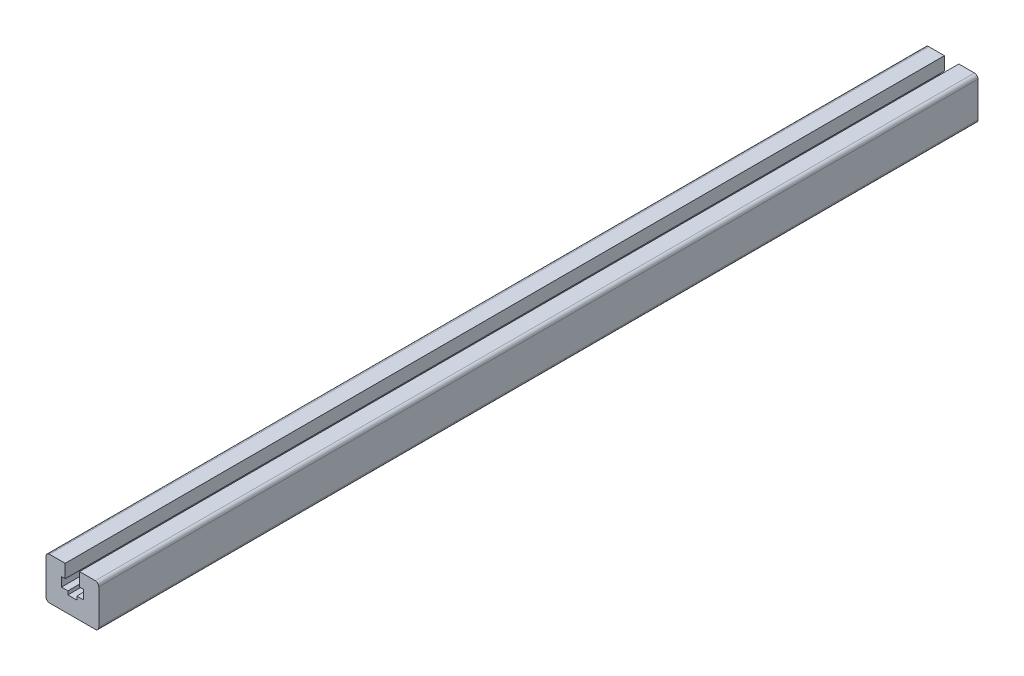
ISO-10303-21;
HEADER;
FILE_DESCRIPTION(('STEP AP214'),'2;1');
FILE_NAME('part.step','',(''),(''),'','','');
FILE_SCHEMA(('AUTOMOTIVE_DESIGN { 1 0 10303 214 1 1 1 1 }'));
ENDSEC;
DATA;
#1=APPLICATION_CONTEXT('core data for automotive mechanical design processes');
#2=APPLICATION_PROTOCOL_DEFINITION('international standard','automotive_design',2000,#1);
#3=PRODUCT_CONTEXT('',#1,'mechanical');
#4=PRODUCT('Part','Part','',(#3));
#5=PRODUCT_RELATED_PRODUCT_CATEGORY('part','',(#4));
#6=PRODUCT_DEFINITION_FORMATION('','',#4);
#7=PRODUCT_DEFINITION_CONTEXT('part definition',#1,'design');
#8=PRODUCT_DEFINITION('design','',#6,#7);
#9=PRODUCT_DEFINITION_SHAPE('','',#8);
#10=(LENGTH_UNIT() NAMED_UNIT(*) SI_UNIT(.MILLI.,.METRE.));
#11=(NAMED_UNIT(*) PLANE_ANGLE_UNIT() SI_UNIT($,.RADIAN.));
#12=(NAMED_UNIT(*) SI_UNIT($,.STERADIAN.) SOLID_ANGLE_UNIT());
#13=UNCERTAINTY_MEASURE_WITH_UNIT(LENGTH_MEASURE(1.E-05),#10,'distance_accuracy_value','');
#14=(GEOMETRIC_REPRESENTATION_CONTEXT(3) GLOBAL_UNCERTAINTY_ASSIGNED_CONTEXT((#13)) GLOBAL_UNIT_ASSIGNED_CONTEXT((#10,
#11,#12)) REPRESENTATION_CONTEXT('',''));
#15=CARTESIAN_POINT('',(0.,0.,0.));
#16=DIRECTION('',(0.,0.,1.));
#17=DIRECTION('',(1.,0.,0.));
#18=AXIS2_PLACEMENT_3D('',#15,#16,#17);
#19=CARTESIAN_POINT('',(4.09999618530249,24.,500.));
#20=DIRECTION('',(0.,1.,0.));
#21=DIRECTION('',(0.,0.,-1.));
#22=AXIS2_PLACEMENT_3D('',#19,#20,#21);
#23=PLANE('',#22);
#24=DIRECTION('',(0.,0.,-1.));
#25=VECTOR('',#24,1.);
#26=CARTESIAN_POINT('',(-4.1,24.,500.));
#27=LINE('',#26,#25);
#28=CARTESIAN_POINT('',(-4.1,24.,500.));
#29=VERTEX_POINT('',#28);
#30=CARTESIAN_POINT('',(-4.1,24.,0.));
#31=VERTEX_POINT('',#30);
#32=EDGE_CURVE('E221',#29,#31,#27,.T.);
#33=ORIENTED_EDGE('',*,*,#32,.T.);
#34=DIRECTION('',(1.,0.,0.));
#35=VECTOR('',#34,1.);
#36=CARTESIAN_POINT('',(4.09999618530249,24.,0.));
#37=LINE('',#36,#35);
#38=CARTESIAN_POINT('',(-13.,24.,0.));
#39=VERTEX_POINT('',#38);
#40=EDGE_CURVE('E172',#39,#31,#37,.T.);
#41=ORIENTED_EDGE('',*,*,#40,.F.);
#42=DIRECTION('',(0.,0.,-1.));
#43=VECTOR('',#42,1.);
#44=CARTESIAN_POINT('',(-13.,24.,500.));
#45=LINE('',#44,#43);
#46=CARTESIAN_POINT('',(-13.,24.,500.));
#47=VERTEX_POINT('',#46);
#48=EDGE_CURVE('E9',#47,#39,#45,.T.);
#49=ORIENTED_EDGE('',*,*,#48,.F.);
#50=DIRECTION('',(1.,0.,0.));
#51=VECTOR('',#50,1.);
#52=CARTESIAN_POINT('',(-13.,24.,500.));
#53=LINE('',#52,#51);
#54=EDGE_CURVE('E171',#47,#29,#53,.T.);
#55=ORIENTED_EDGE('',*,*,#54,.T.);
#56=EDGE_LOOP('',(#33,#41,#49,#55));
#57=FACE_BOUND('',#56,.T.);
#58=ADVANCED_FACE('F14',(#57),#23,.T.);
#59=CARTESIAN_POINT('',(-13.,22.,500.));
#60=DIRECTION('',(0.,0.,-1.));
#61=DIRECTION('',(-1.,0.,0.));
#62=AXIS2_PLACEMENT_3D('',#59,#60,#61);
#63=CYLINDRICAL_SURFACE('',#62,2.);
#64=DIRECTION('',(0.,0.,-1.));
#65=VECTOR('',#64,1.);
#66=CARTESIAN_POINT('',(-15.,22.,500.));
#67=LINE('',#66,#65);
#68=CARTESIAN_POINT('',(-15.,22.,500.));
#69=VERTEX_POINT('',#68);
#70=CARTESIAN_POINT('',(-15.,22.,0.));
#71=VERTEX_POINT('',#70);
#72=EDGE_CURVE('E22',#69,#71,#67,.T.);
#73=ORIENTED_EDGE('',*,*,#72,.F.);
#74=CARTESIAN_POINT('',(-13.,22.,500.));
#75=DIRECTION('',(0.,0.,-1.));
#76=DIRECTION('',(-1.,0.,0.));
#77=AXIS2_PLACEMENT_3D('',#74,#75,#76);
#78=CIRCLE('',#77,2.);
#79=EDGE_CURVE('E175',#69,#47,#78,.T.);
#80=ORIENTED_EDGE('',*,*,#79,.T.);
#81=ORIENTED_EDGE('',*,*,#48,.T.);
#82=CARTESIAN_POINT('',(-13.,22.,0.));
#83=DIRECTION('',(0.,0.,-1.));
#84=DIRECTION('',(-1.,0.,0.));
#85=AXIS2_PLACEMENT_3D('',#82,#83,#84);
#86=CIRCLE('',#85,2.);
#87=EDGE_CURVE('E219',#71,#39,#86,.T.);
#88=ORIENTED_EDGE('',*,*,#87,.F.);
#89=EDGE_LOOP('',(#73,#80,#81,#88));
#90=FACE_BOUND('',#89,.T.);
#91=ADVANCED_FACE('F16',(#90),#63,.T.);
#92=CARTESIAN_POINT('',(-15.,2.,500.));
#93=DIRECTION('',(-1.,0.,0.));
#94=DIRECTION('',(0.,0.,1.));
#95=AXIS2_PLACEMENT_3D('',#92,#93,#94);
#96=PLANE('',#95);
#97=DIRECTION('',(0.,0.,-1.));
#98=VECTOR('',#97,1.);
#99=CARTESIAN_POINT('',(-15.,2.,500.));
#100=LINE('',#99,#98);
#101=CARTESIAN_POINT('',(-15.,2.,500.));
#102=VERTEX_POINT('',#101);
#103=CARTESIAN_POINT('',(-15.,2.,0.));
#104=VERTEX_POINT('',#103);
#105=EDGE_CURVE('E207',#102,#104,#100,.T.);
#106=ORIENTED_EDGE('',*,*,#105,.F.);
#107=DIRECTION('',(0.,1.,0.));
#108=VECTOR('',#107,1.);
#109=CARTESIAN_POINT('',(-15.,2.,500.));
#110=LINE('',#109,#108);
#111=EDGE_CURVE('E182',#102,#69,#110,.T.);
#112=ORIENTED_EDGE('',*,*,#111,.T.);
#113=ORIENTED_EDGE('',*,*,#72,.T.);
#114=DIRECTION('',(0.,1.,0.));
#115=VECTOR('',#114,1.);
#116=CARTESIAN_POINT('',(-15.,2.,0.));
#117=LINE('',#116,#115);
#118=EDGE_CURVE('E213',#104,#71,#117,.T.);
#119=ORIENTED_EDGE('',*,*,#118,.F.);
#120=EDGE_LOOP('',(#106,#112,#113,#119));
#121=FACE_BOUND('',#120,.T.);
#122=ADVANCED_FACE('F211',(#121),#96,.T.);
#123=CARTESIAN_POINT('',(-13.,2.,500.));
#124=DIRECTION('',(0.,0.,-1.));
#125=DIRECTION('',(-1.,0.,0.));
#126=AXIS2_PLACEMENT_3D('',#123,#124,#125);
#127=CYLINDRICAL_SURFACE('',#126,2.);
#128=DIRECTION('',(0.,0.,-1.));
#129=VECTOR('',#128,1.);
#130=CARTESIAN_POINT('',(-13.,0.,500.));
#131=LINE('',#130,#129);
#132=CARTESIAN_POINT('',(-13.,0.,500.));
#133=VERTEX_POINT('',#132);
#134=CARTESIAN_POINT('',(-13.,0.,0.));
#135=VERTEX_POINT('',#134);
#136=EDGE_CURVE('E205',#133,#135,#131,.T.);
#137=ORIENTED_EDGE('',*,*,#136,.F.);
#138=CARTESIAN_POINT('',(-13.,2.,500.));
#139=DIRECTION('',(0.,0.,-1.));
#140=DIRECTION('',(-1.,0.,0.));
#141=AXIS2_PLACEMENT_3D('',#138,#139,#140);
#142=CIRCLE('',#141,2.);
#143=EDGE_CURVE('E185',#133,#102,#142,.T.);
#144=ORIENTED_EDGE('',*,*,#143,.T.);
#145=ORIENTED_EDGE('',*,*,#105,.T.);
#146=CARTESIAN_POINT('',(-13.,2.,0.));
#147=DIRECTION('',(0.,0.,-1.));
#148=DIRECTION('',(-1.,0.,0.));
#149=AXIS2_PLACEMENT_3D('',#146,#147,#148);
#150=CIRCLE('',#149,2.);
#151=EDGE_CURVE('E227',#135,#104,#150,.T.);
#152=ORIENTED_EDGE('',*,*,#151,.F.);
#153=EDGE_LOOP('',(#137,#144,#145,#152));
#154=FACE_BOUND('',#153,.T.);
#155=ADVANCED_FACE('F259',(#154),#127,.T.);
#156=CARTESIAN_POINT('',(-13.,0.,500.));
#157=DIRECTION('',(0.,1.,0.));
#158=DIRECTION('',(0.,0.,-1.));
#159=AXIS2_PLACEMENT_3D('',#156,#157,#158);
#160=PLANE('',#159);
#161=DIRECTION('',(0.,0.,-1.));
#162=VECTOR('',#161,1.);
#163=CARTESIAN_POINT('',(13.,0.,500.));
#164=LINE('',#163,#162);
#165=CARTESIAN_POINT('',(13.,0.,500.));
#166=VERTEX_POINT('',#165);
#167=CARTESIAN_POINT('',(13.,0.,0.));
#168=VERTEX_POINT('',#167);
#169=EDGE_CURVE('E203',#166,#168,#164,.T.);
#170=ORIENTED_EDGE('',*,*,#169,.F.);
#171=DIRECTION('',(1.,0.,0.));
#172=VECTOR('',#171,1.);
#173=CARTESIAN_POINT('',(-13.,0.,500.));
#174=LINE('',#173,#172);
#175=EDGE_CURVE('E188',#133,#166,#174,.T.);
#176=ORIENTED_EDGE('',*,*,#175,.F.);
#177=ORIENTED_EDGE('',*,*,#136,.T.);
#178=DIRECTION('',(1.,0.,0.));
#179=VECTOR('',#178,1.);
#180=CARTESIAN_POINT('',(-13.,0.,0.));
#181=LINE('',#180,#179);
#182=EDGE_CURVE('E229',#135,#168,#181,.T.);
#183=ORIENTED_EDGE('',*,*,#182,.T.);
#184=EDGE_LOOP('',(#170,#176,#177,#183));
#185=FACE_BOUND('',#184,.T.);
#186=ADVANCED_FACE('F256',(#185),#160,.F.);
#187=CARTESIAN_POINT('',(13.,2.,500.));
#188=DIRECTION('',(0.,0.,-1.));
#189=DIRECTION('',(-1.,0.,0.));
#190=AXIS2_PLACEMENT_3D('',#187,#188,#189);
#191=CYLINDRICAL_SURFACE('',#190,2.);
#192=DIRECTION('',(0.,0.,-1.));
#193=VECTOR('',#192,1.);
#194=CARTESIAN_POINT('',(15.,2.,500.));
#195=LINE('',#194,#193);
#196=CARTESIAN_POINT('',(15.,2.,500.));
#197=VERTEX_POINT('',#196);
#198=CARTESIAN_POINT('',(15.,2.,0.));
#199=VERTEX_POINT('',#198);
#200=EDGE_CURVE('E201',#197,#199,#195,.T.);
#201=ORIENTED_EDGE('',*,*,#200,.F.);
#202=CARTESIAN_POINT('',(13.,2.,500.));
#203=DIRECTION('',(0.,0.,-1.));
#204=DIRECTION('',(-1.,0.,0.));
#205=AXIS2_PLACEMENT_3D('',#202,#203,#204);
#206=CIRCLE('',#205,2.);
#207=EDGE_CURVE('E191',#197,#166,#206,.T.);
#208=ORIENTED_EDGE('',*,*,#207,.T.);
#209=ORIENTED_EDGE('',*,*,#169,.T.);
#210=CARTESIAN_POINT('',(13.,2.,0.));
#211=DIRECTION('',(0.,0.,-1.));
#212=DIRECTION('',(-1.,0.,0.));
#213=AXIS2_PLACEMENT_3D('',#210,#211,#212);
#214=CIRCLE('',#213,2.);
#215=EDGE_CURVE('E234',#199,#168,#214,.T.);
#216=ORIENTED_EDGE('',*,*,#215,.F.);
#217=EDGE_LOOP('',(#201,#208,#209,#216));
#218=FACE_BOUND('',#217,.T.);
#219=ADVANCED_FACE('F252',(#218),#191,.T.);
#220=CARTESIAN_POINT('',(15.,2.,500.));
#221=DIRECTION('',(-1.,0.,0.));
#222=DIRECTION('',(0.,0.,1.));
#223=AXIS2_PLACEMENT_3D('',#220,#221,#222);
#224=PLANE('',#223);
#225=DIRECTION('',(0.,0.,-1.));
#226=VECTOR('',#225,1.);
#227=CARTESIAN_POINT('',(15.,22.,500.));
#228=LINE('',#227,#226);
#229=CARTESIAN_POINT('',(15.,22.,500.));
#230=VERTEX_POINT('',#229);
#231=CARTESIAN_POINT('',(15.,22.,0.));
#232=VERTEX_POINT('',#231);
#233=EDGE_CURVE('E199',#230,#232,#228,.T.);
#234=ORIENTED_EDGE('',*,*,#233,.F.);
#235=DIRECTION('',(0.,1.,0.));
#236=VECTOR('',#235,1.);
#237=CARTESIAN_POINT('',(15.,2.,500.));
#238=LINE('',#237,#236);
#239=EDGE_CURVE('E194',#197,#230,#238,.T.);
#240=ORIENTED_EDGE('',*,*,#239,.F.);
#241=ORIENTED_EDGE('',*,*,#200,.T.);
#242=DIRECTION('',(0.,1.,0.));
#243=VECTOR('',#242,1.);
#244=CARTESIAN_POINT('',(15.,2.,0.));
#245=LINE('',#244,#243);
#246=EDGE_CURVE('E237',#199,#232,#245,.T.);
#247=ORIENTED_EDGE('',*,*,#246,.T.);
#248=EDGE_LOOP('',(#234,#240,#241,#247));
#249=FACE_BOUND('',#248,.T.);
#250=ADVANCED_FACE('F249',(#249),#224,.F.);
#251=CARTESIAN_POINT('',(13.,22.,500.));
#252=DIRECTION('',(0.,0.,-1.));
#253=DIRECTION('',(-1.,0.,0.));
#254=AXIS2_PLACEMENT_3D('',#251,#252,#253);
#255=CYLINDRICAL_SURFACE('',#254,2.);
#256=DIRECTION('',(0.,0.,-1.));
#257=VECTOR('',#256,1.);
#258=CARTESIAN_POINT('',(13.,24.,500.));
#259=LINE('',#258,#257);
#260=CARTESIAN_POINT('',(13.,24.,500.));
#261=VERTEX_POINT('',#260);
#262=CARTESIAN_POINT('',(13.,24.,0.));
#263=VERTEX_POINT('',#262);
#264=EDGE_CURVE('E197',#261,#263,#259,.T.);
#265=ORIENTED_EDGE('',*,*,#264,.F.);
#266=CARTESIAN_POINT('',(13.,22.,500.));
#267=DIRECTION('',(0.,0.,-1.));
#268=DIRECTION('',(-1.,0.,0.));
#269=AXIS2_PLACEMENT_3D('',#266,#267,#268);
#270=CIRCLE('',#269,2.);
#271=EDGE_CURVE('E170',#261,#230,#270,.T.);
#272=ORIENTED_EDGE('',*,*,#271,.T.);
#273=ORIENTED_EDGE('',*,*,#233,.T.);
#274=CARTESIAN_POINT('',(13.,22.,0.));
#275=DIRECTION('',(0.,0.,-1.));
#276=DIRECTION('',(-1.,0.,0.));
#277=AXIS2_PLACEMENT_3D('',#274,#275,#276);
#278=CIRCLE('',#277,2.);
#279=EDGE_CURVE('E239',#263,#232,#278,.T.);
#280=ORIENTED_EDGE('',*,*,#279,.F.);
#281=EDGE_LOOP('',(#265,#272,#273,#280));
#282=FACE_BOUND('',#281,.T.);
#283=ADVANCED_FACE('F246',(#282),#255,.T.);
#284=DIRECTION('',(0.,0.,-1.));
#285=VECTOR('',#284,1.);
#286=CARTESIAN_POINT('',(4.1,24.,500.));
#287=LINE('',#286,#285);
#288=CARTESIAN_POINT('',(4.1,24.,500.));
#289=VERTEX_POINT('',#288);
#290=CARTESIAN_POINT('',(4.1,24.,0.));
#291=VERTEX_POINT('',#290);
#292=EDGE_CURVE('E29',#289,#291,#287,.T.);
#293=ORIENTED_EDGE('',*,*,#292,.F.);
#294=EDGE_CURVE('E36',#289,#261,#53,.T.);
#295=ORIENTED_EDGE('',*,*,#294,.T.);
#296=ORIENTED_EDGE('',*,*,#264,.T.);
#297=EDGE_CURVE('E162',#291,#263,#37,.T.);
#298=ORIENTED_EDGE('',*,*,#297,.F.);
#299=EDGE_LOOP('',(#293,#295,#296,#298));
#300=FACE_BOUND('',#299,.T.);
#301=ADVANCED_FACE('F161',(#300),#23,.T.);
#302=CARTESIAN_POINT('',(-13.,22.,500.));
#303=DIRECTION('',(0.,0.,-1.));
#304=DIRECTION('',(-1.,0.,0.));
#305=AXIS2_PLACEMENT_3D('',#302,#303,#304);
#306=PLANE('',#305);
#307=DIRECTION('',(1.,0.,0.));
#308=VECTOR('',#307,1.);
#309=CARTESIAN_POINT('',(-4.1,16.4,500.));
#310=LINE('',#309,#308);
#311=CARTESIAN_POINT('',(-6.2,16.4,500.));
#312=VERTEX_POINT('',#311);
#313=CARTESIAN_POINT('',(-4.1,16.4,500.));
#314=VERTEX_POINT('',#313);
#315=EDGE_CURVE('E371',#312,#314,#310,.T.);
#316=ORIENTED_EDGE('',*,*,#315,.T.);
#317=DIRECTION('',(0.,1.,0.));
#318=VECTOR('',#317,1.);
#319=CARTESIAN_POINT('',(-4.1,24.,500.));
#320=LINE('',#319,#318);
#321=EDGE_CURVE('E163',#314,#29,#320,.T.);
#322=ORIENTED_EDGE('',*,*,#321,.T.);
#323=ORIENTED_EDGE('',*,*,#54,.F.);
#324=ORIENTED_EDGE('',*,*,#79,.F.);
#325=ORIENTED_EDGE('',*,*,#111,.F.);
#326=ORIENTED_EDGE('',*,*,#143,.F.);
#327=ORIENTED_EDGE('',*,*,#175,.T.);
#328=ORIENTED_EDGE('',*,*,#207,.F.);
#329=ORIENTED_EDGE('',*,*,#239,.T.);
#330=ORIENTED_EDGE('',*,*,#271,.F.);
#331=ORIENTED_EDGE('',*,*,#294,.F.);
#332=DIRECTION('',(0.,-1.,0.));
#333=VECTOR('',#332,1.);
#334=CARTESIAN_POINT('',(4.1,16.4,500.));
#335=LINE('',#334,#333);
#336=CARTESIAN_POINT('',(4.1,16.4,500.));
#337=VERTEX_POINT('',#336);
#338=EDGE_CURVE('E151',#289,#337,#335,.T.);
#339=ORIENTED_EDGE('',*,*,#338,.T.);
#340=DIRECTION('',(1.,0.,0.));
#341=VECTOR('',#340,1.);
#342=CARTESIAN_POINT('',(6.2,16.4,500.));
#343=LINE('',#342,#341);
#344=CARTESIAN_POINT('',(6.2,16.4,500.));
#345=VERTEX_POINT('',#344);
#346=EDGE_CURVE('E157',#337,#345,#343,.T.);
#347=ORIENTED_EDGE('',*,*,#346,.T.);
#348=DIRECTION('',(0.,-1.,0.));
#349=VECTOR('',#348,1.);
#350=CARTESIAN_POINT('',(6.2,11.2,500.));
#351=LINE('',#350,#349);
#352=CARTESIAN_POINT('',(6.2,11.2,500.));
#353=VERTEX_POINT('',#352);
#354=EDGE_CURVE('E358',#345,#353,#351,.T.);
#355=ORIENTED_EDGE('',*,*,#354,.T.);
#356=DIRECTION('',(-1.,0.,0.));
#357=VECTOR('',#356,1.);
#358=CARTESIAN_POINT('',(2.55,11.2,500.));
#359=LINE('',#358,#357);
#360=CARTESIAN_POINT('',(2.55,11.2,500.));
#361=VERTEX_POINT('',#360);
#362=EDGE_CURVE('E353',#353,#361,#359,.T.);
#363=ORIENTED_EDGE('',*,*,#362,.T.);
#364=DIRECTION('',(0.,-1.,0.));
#365=VECTOR('',#364,1.);
#366=CARTESIAN_POINT('',(2.55,9.2,500.));
#367=LINE('',#366,#365);
#368=CARTESIAN_POINT('',(2.55,9.2,500.));
#369=VERTEX_POINT('',#368);
#370=EDGE_CURVE('E348',#361,#369,#367,.T.);
#371=ORIENTED_EDGE('',*,*,#370,.T.);
#372=DIRECTION('',(-1.,0.,0.));
#373=VECTOR('',#372,1.);
#374=CARTESIAN_POINT('',(-2.55,9.2,500.));
#375=LINE('',#374,#373);
#376=CARTESIAN_POINT('',(-2.55,9.2,500.));
#377=VERTEX_POINT('',#376);
#378=EDGE_CURVE('E364',#369,#377,#375,.T.);
#379=ORIENTED_EDGE('',*,*,#378,.T.);
#380=DIRECTION('',(0.,1.,0.));
#381=VECTOR('',#380,1.);
#382=CARTESIAN_POINT('',(-2.55,11.2,500.));
#383=LINE('',#382,#381);
#384=CARTESIAN_POINT('',(-2.55,11.2,500.));
#385=VERTEX_POINT('',#384);
#386=EDGE_CURVE('E338',#377,#385,#383,.T.);
#387=ORIENTED_EDGE('',*,*,#386,.T.);
#388=DIRECTION('',(-1.,0.,0.));
#389=VECTOR('',#388,1.);
#390=CARTESIAN_POINT('',(-6.2,11.2,500.));
#391=LINE('',#390,#389);
#392=CARTESIAN_POINT('',(-6.2,11.2,500.));
#393=VERTEX_POINT('',#392);
#394=EDGE_CURVE('E333',#385,#393,#391,.T.);
#395=ORIENTED_EDGE('',*,*,#394,.T.);
#396=DIRECTION('',(0.,1.,0.));
#397=VECTOR('',#396,1.);
#398=CARTESIAN_POINT('',(-6.2,16.4,500.));
#399=LINE('',#398,#397);
#400=EDGE_CURVE('E368',#393,#312,#399,.T.);
#401=ORIENTED_EDGE('',*,*,#400,.T.);
#402=EDGE_LOOP('',(#316,#322,#323,#324,#325,#326,#327,#328,#329,#330,#331,#339,#347,#355,#363,
#371,#379,#387,#395,#401));
#403=FACE_BOUND('',#402,.T.);
#404=ADVANCED_FACE('F167',(#403),#306,.F.);
#405=CARTESIAN_POINT('',(-13.,22.,0.));
#406=DIRECTION('',(0.,0.,-1.));
#407=DIRECTION('',(-1.,0.,0.));
#408=AXIS2_PLACEMENT_3D('',#405,#406,#407);
#409=PLANE('',#408);
#410=DIRECTION('',(0.,1.,0.));
#411=VECTOR('',#410,1.);
#412=CARTESIAN_POINT('',(-4.1,24.,0.));
#413=LINE('',#412,#411);
#414=CARTESIAN_POINT('',(-4.1,16.4,0.));
#415=VERTEX_POINT('',#414);
#416=EDGE_CURVE('E158',#415,#31,#413,.T.);
#417=ORIENTED_EDGE('',*,*,#416,.F.);
#418=DIRECTION('',(1.,0.,0.));
#419=VECTOR('',#418,1.);
#420=CARTESIAN_POINT('',(-4.1,16.4,0.));
#421=LINE('',#420,#419);
#422=CARTESIAN_POINT('',(-6.2,16.4,0.));
#423=VERTEX_POINT('',#422);
#424=EDGE_CURVE('E268',#423,#415,#421,.T.);
#425=ORIENTED_EDGE('',*,*,#424,.F.);
#426=DIRECTION('',(0.,1.,0.));
#427=VECTOR('',#426,1.);
#428=CARTESIAN_POINT('',(-6.2,16.4,0.));
#429=LINE('',#428,#427);
#430=CARTESIAN_POINT('',(-6.2,11.2,0.));
#431=VERTEX_POINT('',#430);
#432=EDGE_CURVE('E271',#431,#423,#429,.T.);
#433=ORIENTED_EDGE('',*,*,#432,.F.);
#434=DIRECTION('',(-1.,0.,0.));
#435=VECTOR('',#434,1.);
#436=CARTESIAN_POINT('',(-6.2,11.2,0.));
#437=LINE('',#436,#435);
#438=CARTESIAN_POINT('',(-2.55,11.2,0.));
#439=VERTEX_POINT('',#438);
#440=EDGE_CURVE('E319',#439,#431,#437,.T.);
#441=ORIENTED_EDGE('',*,*,#440,.F.);
#442=DIRECTION('',(0.,1.,0.));
#443=VECTOR('',#442,1.);
#444=CARTESIAN_POINT('',(-2.55,11.2,0.));
#445=LINE('',#444,#443);
#446=CARTESIAN_POINT('',(-2.55,9.2,0.));
#447=VERTEX_POINT('',#446);
#448=EDGE_CURVE('E316',#447,#439,#445,.T.);
#449=ORIENTED_EDGE('',*,*,#448,.F.);
#450=DIRECTION('',(-1.,0.,0.));
#451=VECTOR('',#450,1.);
#452=CARTESIAN_POINT('',(-2.55,9.2,0.));
#453=LINE('',#452,#451);
#454=CARTESIAN_POINT('',(2.55,9.2,0.));
#455=VERTEX_POINT('',#454);
#456=EDGE_CURVE('E313',#455,#447,#453,.T.);
#457=ORIENTED_EDGE('',*,*,#456,.F.);
#458=DIRECTION('',(0.,-1.,0.));
#459=VECTOR('',#458,1.);
#460=CARTESIAN_POINT('',(2.55,9.2,0.));
#461=LINE('',#460,#459);
#462=CARTESIAN_POINT('',(2.55,11.2,0.));
#463=VERTEX_POINT('',#462);
#464=EDGE_CURVE('E310',#463,#455,#461,.T.);
#465=ORIENTED_EDGE('',*,*,#464,.F.);
#466=DIRECTION('',(-1.,0.,0.));
#467=VECTOR('',#466,1.);
#468=CARTESIAN_POINT('',(2.55,11.2,0.));
#469=LINE('',#468,#467);
#470=CARTESIAN_POINT('',(6.2,11.2,0.));
#471=VERTEX_POINT('',#470);
#472=EDGE_CURVE('E304',#471,#463,#469,.T.);
#473=ORIENTED_EDGE('',*,*,#472,.F.);
#474=DIRECTION('',(0.,-1.,0.));
#475=VECTOR('',#474,1.);
#476=CARTESIAN_POINT('',(6.2,11.2,0.));
#477=LINE('',#476,#475);
#478=CARTESIAN_POINT('',(6.2,16.4,0.));
#479=VERTEX_POINT('',#478);
#480=EDGE_CURVE('E302',#479,#471,#477,.T.);
#481=ORIENTED_EDGE('',*,*,#480,.F.);
#482=DIRECTION('',(1.,0.,0.));
#483=VECTOR('',#482,1.);
#484=CARTESIAN_POINT('',(6.2,16.4,0.));
#485=LINE('',#484,#483);
#486=CARTESIAN_POINT('',(4.1,16.4,0.));
#487=VERTEX_POINT('',#486);
#488=EDGE_CURVE('E297',#487,#479,#485,.T.);
#489=ORIENTED_EDGE('',*,*,#488,.F.);
#490=DIRECTION('',(0.,-1.,0.));
#491=VECTOR('',#490,1.);
#492=CARTESIAN_POINT('',(4.1,16.4,0.));
#493=LINE('',#492,#491);
#494=EDGE_CURVE('E244',#291,#487,#493,.T.);
#495=ORIENTED_EDGE('',*,*,#494,.F.);
#496=ORIENTED_EDGE('',*,*,#297,.T.);
#497=ORIENTED_EDGE('',*,*,#279,.T.);
#498=ORIENTED_EDGE('',*,*,#246,.F.);
#499=ORIENTED_EDGE('',*,*,#215,.T.);
#500=ORIENTED_EDGE('',*,*,#182,.F.);
#501=ORIENTED_EDGE('',*,*,#151,.T.);
#502=ORIENTED_EDGE('',*,*,#118,.T.);
#503=ORIENTED_EDGE('',*,*,#87,.T.);
#504=ORIENTED_EDGE('',*,*,#40,.T.);
#505=EDGE_LOOP('',(#417,#425,#433,#441,#449,#457,#465,#473,#481,#489,#495,#496,#497,#498,#499,
#500,#501,#502,#503,#504));
#506=FACE_BOUND('',#505,.T.);
#507=ADVANCED_FACE('F224',(#506),#409,.T.);
#508=CARTESIAN_POINT('',(-4.1,24.,500.));
#509=DIRECTION('',(-1.,0.,0.));
#510=DIRECTION('',(0.,0.,1.));
#511=AXIS2_PLACEMENT_3D('',#508,#509,#510);
#512=PLANE('',#511);
#513=ORIENTED_EDGE('',*,*,#416,.T.);
#514=ORIENTED_EDGE('',*,*,#32,.F.);
#515=ORIENTED_EDGE('',*,*,#321,.F.);
#516=DIRECTION('',(0.,0.,-1.));
#517=VECTOR('',#516,1.);
#518=CARTESIAN_POINT('',(-4.1,16.4,500.));
#519=LINE('',#518,#517);
#520=EDGE_CURVE('E276',#314,#415,#519,.T.);
#521=ORIENTED_EDGE('',*,*,#520,.T.);
#522=EDGE_LOOP('',(#513,#514,#515,#521));
#523=FACE_BOUND('',#522,.T.);
#524=ADVANCED_FACE('F374',(#523),#512,.F.);
#525=CARTESIAN_POINT('',(-4.1,16.4,500.));
#526=DIRECTION('',(0.,1.,0.));
#527=DIRECTION('',(0.,0.,1.));
#528=AXIS2_PLACEMENT_3D('',#525,#526,#527);
#529=PLANE('',#528);
#530=ORIENTED_EDGE('',*,*,#424,.T.);
#531=ORIENTED_EDGE('',*,*,#520,.F.);
#532=ORIENTED_EDGE('',*,*,#315,.F.);
#533=DIRECTION('',(0.,0.,-1.));
#534=VECTOR('',#533,1.);
#535=CARTESIAN_POINT('',(-6.2,16.4,500.));
#536=LINE('',#535,#534);
#537=EDGE_CURVE('E278',#312,#423,#536,.T.);
#538=ORIENTED_EDGE('',*,*,#537,.T.);
#539=EDGE_LOOP('',(#530,#531,#532,#538));
#540=FACE_BOUND('',#539,.T.);
#541=ADVANCED_FACE('F373',(#540),#529,.F.);
#542=CARTESIAN_POINT('',(-6.2,16.4,500.));
#543=DIRECTION('',(-1.,0.,0.));
#544=DIRECTION('',(0.,0.,1.));
#545=AXIS2_PLACEMENT_3D('',#542,#543,#544);
#546=PLANE('',#545);
#547=ORIENTED_EDGE('',*,*,#432,.T.);
#548=ORIENTED_EDGE('',*,*,#537,.F.);
#549=ORIENTED_EDGE('',*,*,#400,.F.);
#550=DIRECTION('',(0.,0.,-1.));
#551=VECTOR('',#550,1.);
#552=CARTESIAN_POINT('',(-6.2,11.2,500.));
#553=LINE('',#552,#551);
#554=EDGE_CURVE('E280',#393,#431,#553,.T.);
#555=ORIENTED_EDGE('',*,*,#554,.T.);
#556=EDGE_LOOP('',(#547,#548,#549,#555));
#557=FACE_BOUND('',#556,.T.);
#558=ADVANCED_FACE('F323',(#557),#546,.F.);
#559=CARTESIAN_POINT('',(-6.2,11.2,500.));
#560=DIRECTION('',(0.,-1.,0.));
#561=DIRECTION('',(0.,0.,-1.));
#562=AXIS2_PLACEMENT_3D('',#559,#560,#561);
#563=PLANE('',#562);
#564=ORIENTED_EDGE('',*,*,#440,.T.);
#565=ORIENTED_EDGE('',*,*,#554,.F.);
#566=ORIENTED_EDGE('',*,*,#394,.F.);
#567=DIRECTION('',(0.,0.,-1.));
#568=VECTOR('',#567,1.);
#569=CARTESIAN_POINT('',(-2.55,11.2,500.));
#570=LINE('',#569,#568);
#571=EDGE_CURVE('E282',#385,#439,#570,.T.);
#572=ORIENTED_EDGE('',*,*,#571,.T.);
#573=EDGE_LOOP('',(#564,#565,#566,#572));
#574=FACE_BOUND('',#573,.T.);
#575=ADVANCED_FACE('F330',(#574),#563,.F.);
#576=CARTESIAN_POINT('',(-2.55,11.2,500.));
#577=DIRECTION('',(-1.,0.,0.));
#578=DIRECTION('',(0.,0.,1.));
#579=AXIS2_PLACEMENT_3D('',#576,#577,#578);
#580=PLANE('',#579);
#581=ORIENTED_EDGE('',*,*,#448,.T.);
#582=ORIENTED_EDGE('',*,*,#571,.F.);
#583=ORIENTED_EDGE('',*,*,#386,.F.);
#584=DIRECTION('',(0.,0.,-1.));
#585=VECTOR('',#584,1.);
#586=CARTESIAN_POINT('',(-2.55,9.2,500.));
#587=LINE('',#586,#585);
#588=EDGE_CURVE('E284',#377,#447,#587,.T.);
#589=ORIENTED_EDGE('',*,*,#588,.T.);
#590=EDGE_LOOP('',(#581,#582,#583,#589));
#591=FACE_BOUND('',#590,.T.);
#592=ADVANCED_FACE('F337',(#591),#580,.F.);
#593=CARTESIAN_POINT('',(-2.55,9.2,500.));
#594=DIRECTION('',(0.,-1.,0.));
#595=DIRECTION('',(1.,0.,0.));
#596=AXIS2_PLACEMENT_3D('',#593,#594,#595);
#597=PLANE('',#596);
#598=ORIENTED_EDGE('',*,*,#456,.T.);
#599=ORIENTED_EDGE('',*,*,#588,.F.);
#600=ORIENTED_EDGE('',*,*,#378,.F.);
#601=DIRECTION('',(0.,0.,-1.));
#602=VECTOR('',#601,1.);
#603=CARTESIAN_POINT('',(2.55,9.2,500.));
#604=LINE('',#603,#602);
#605=EDGE_CURVE('E286',#369,#455,#604,.T.);
#606=ORIENTED_EDGE('',*,*,#605,.T.);
#607=EDGE_LOOP('',(#598,#599,#600,#606));
#608=FACE_BOUND('',#607,.T.);
#609=ADVANCED_FACE('F342',(#608),#597,.F.);
#610=CARTESIAN_POINT('',(2.55,9.2,500.));
#611=DIRECTION('',(1.,0.,0.));
#612=DIRECTION('',(0.,0.,-1.));
#613=AXIS2_PLACEMENT_3D('',#610,#611,#612);
#614=PLANE('',#613);
#615=ORIENTED_EDGE('',*,*,#464,.T.);
#616=ORIENTED_EDGE('',*,*,#605,.F.);
#617=ORIENTED_EDGE('',*,*,#370,.F.);
#618=DIRECTION('',(0.,0.,-1.));
#619=VECTOR('',#618,1.);
#620=CARTESIAN_POINT('',(2.55,11.2,500.));
#621=LINE('',#620,#619);
#622=EDGE_CURVE('E288',#361,#463,#621,.T.);
#623=ORIENTED_EDGE('',*,*,#622,.T.);
#624=EDGE_LOOP('',(#615,#616,#617,#623));
#625=FACE_BOUND('',#624,.T.);
#626=ADVANCED_FACE('F345',(#625),#614,.F.);
#627=CARTESIAN_POINT('',(2.55,11.2,500.));
#628=DIRECTION('',(0.,-1.,0.));
#629=DIRECTION('',(0.,0.,-1.));
#630=AXIS2_PLACEMENT_3D('',#627,#628,#629);
#631=PLANE('',#630);
#632=ORIENTED_EDGE('',*,*,#472,.T.);
#633=ORIENTED_EDGE('',*,*,#622,.F.);
#634=ORIENTED_EDGE('',*,*,#362,.F.);
#635=DIRECTION('',(0.,0.,-1.));
#636=VECTOR('',#635,1.);
#637=CARTESIAN_POINT('',(6.2,11.2,500.));
#638=LINE('',#637,#636);
#639=EDGE_CURVE('E290',#353,#471,#638,.T.);
#640=ORIENTED_EDGE('',*,*,#639,.T.);
#641=EDGE_LOOP('',(#632,#633,#634,#640));
#642=FACE_BOUND('',#641,.T.);
#643=ADVANCED_FACE('F352',(#642),#631,.F.);
#644=CARTESIAN_POINT('',(6.2,11.2,500.));
#645=DIRECTION('',(1.,0.,0.));
#646=DIRECTION('',(0.,0.,-1.));
#647=AXIS2_PLACEMENT_3D('',#644,#645,#646);
#648=PLANE('',#647);
#649=ORIENTED_EDGE('',*,*,#480,.T.);
#650=ORIENTED_EDGE('',*,*,#639,.F.);
#651=ORIENTED_EDGE('',*,*,#354,.F.);
#652=DIRECTION('',(0.,0.,-1.));
#653=VECTOR('',#652,1.);
#654=CARTESIAN_POINT('',(6.2,16.4,500.));
#655=LINE('',#654,#653);
#656=EDGE_CURVE('E292',#345,#479,#655,.T.);
#657=ORIENTED_EDGE('',*,*,#656,.T.);
#658=EDGE_LOOP('',(#649,#650,#651,#657));
#659=FACE_BOUND('',#658,.T.);
#660=ADVANCED_FACE('F357',(#659),#648,.F.);
#661=CARTESIAN_POINT('',(6.2,16.4,500.));
#662=DIRECTION('',(0.,1.,0.));
#663=DIRECTION('',(0.,0.,1.));
#664=AXIS2_PLACEMENT_3D('',#661,#662,#663);
#665=PLANE('',#664);
#666=ORIENTED_EDGE('',*,*,#488,.T.);
#667=ORIENTED_EDGE('',*,*,#656,.F.);
#668=ORIENTED_EDGE('',*,*,#346,.F.);
#669=DIRECTION('',(0.,0.,-1.));
#670=VECTOR('',#669,1.);
#671=CARTESIAN_POINT('',(4.1,16.4,500.));
#672=LINE('',#671,#670);
#673=EDGE_CURVE('E153',#337,#487,#672,.T.);
#674=ORIENTED_EDGE('',*,*,#673,.T.);
#675=EDGE_LOOP('',(#666,#667,#668,#674));
#676=FACE_BOUND('',#675,.T.);
#677=ADVANCED_FACE('F296',(#676),#665,.F.);
#678=CARTESIAN_POINT('',(4.1,16.4,500.));
#679=DIRECTION('',(1.,0.,0.));
#680=DIRECTION('',(0.,0.,-1.));
#681=AXIS2_PLACEMENT_3D('',#678,#679,#680);
#682=PLANE('',#681);
#683=ORIENTED_EDGE('',*,*,#494,.T.);
#684=ORIENTED_EDGE('',*,*,#673,.F.);
#685=ORIENTED_EDGE('',*,*,#338,.F.);
#686=ORIENTED_EDGE('',*,*,#292,.T.);
#687=EDGE_LOOP('',(#683,#684,#685,#686));
#688=FACE_BOUND('',#687,.T.);
#689=ADVANCED_FACE('F152',(#688),#682,.F.);
#690=CLOSED_SHELL('',(#58,#91,#122,#155,#186,#219,#250,#283,#301,#404,#507,#524,#541,#558,#575,
#592,#609,#626,#643,#660,#677,#689));
#691=MANIFOLD_SOLID_BREP('B1',#690);
#692=ADVANCED_BREP_SHAPE_REPRESENTATION('',(#18,#691),#14);
#693=SHAPE_DEFINITION_REPRESENTATION(#9,#692);
ENDSEC;
END-ISO-10303-21;
